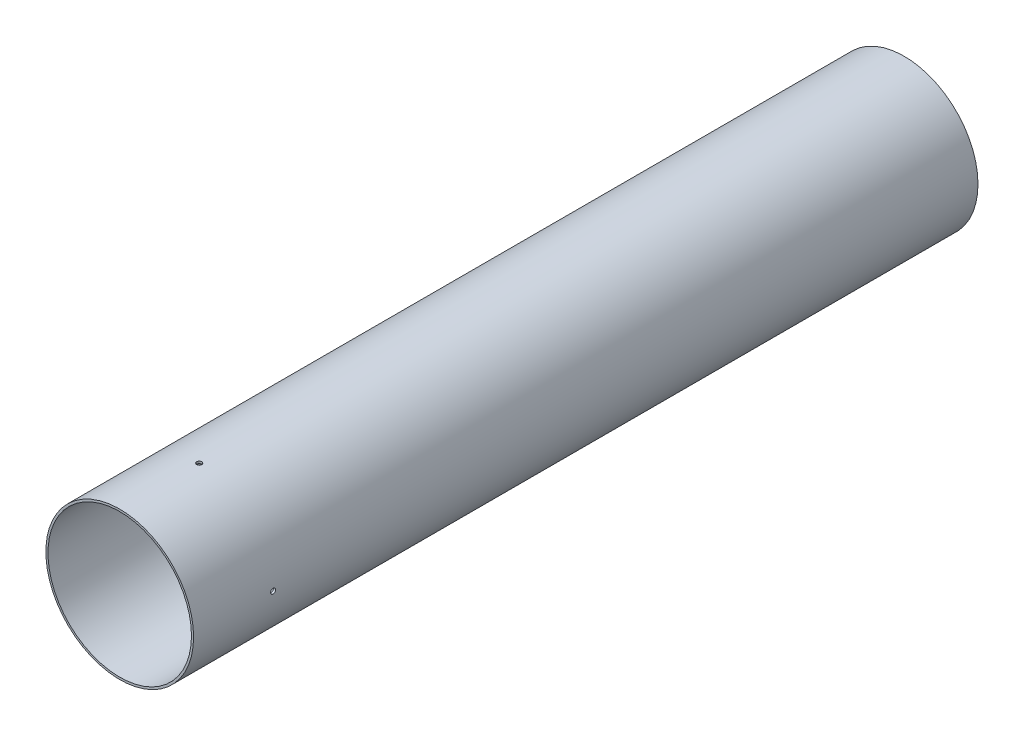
ISO-10303-21;
HEADER;
FILE_DESCRIPTION(('STEP AP214'),'2;1');
FILE_NAME('part.step','',(''),(''),'','','');
FILE_SCHEMA(('AUTOMOTIVE_DESIGN { 1 0 10303 214 1 1 1 1 }'));
ENDSEC;
DATA;
#1=APPLICATION_CONTEXT('core data for automotive mechanical design processes');
#2=APPLICATION_PROTOCOL_DEFINITION('international standard','automotive_design',2000,#1);
#3=PRODUCT_CONTEXT('',#1,'mechanical');
#4=PRODUCT('Part','Part','',(#3));
#5=PRODUCT_RELATED_PRODUCT_CATEGORY('part','',(#4));
#6=PRODUCT_DEFINITION_FORMATION('','',#4);
#7=PRODUCT_DEFINITION_CONTEXT('part definition',#1,'design');
#8=PRODUCT_DEFINITION('design','',#6,#7);
#9=PRODUCT_DEFINITION_SHAPE('','',#8);
#10=(LENGTH_UNIT() NAMED_UNIT(*) SI_UNIT(.MILLI.,.METRE.));
#11=(NAMED_UNIT(*) PLANE_ANGLE_UNIT() SI_UNIT($,.RADIAN.));
#12=(NAMED_UNIT(*) SI_UNIT($,.STERADIAN.) SOLID_ANGLE_UNIT());
#13=UNCERTAINTY_MEASURE_WITH_UNIT(LENGTH_MEASURE(1.E-05),#10,'distance_accuracy_value','');
#14=(GEOMETRIC_REPRESENTATION_CONTEXT(3) GLOBAL_UNCERTAINTY_ASSIGNED_CONTEXT((#13)) GLOBAL_UNIT_ASSIGNED_CONTEXT((#10,
#11,#12)) REPRESENTATION_CONTEXT('',''));
#15=CARTESIAN_POINT('',(0.,0.,0.));
#16=DIRECTION('',(0.,0.,1.));
#17=DIRECTION('',(1.,0.,0.));
#18=AXIS2_PLACEMENT_3D('',#15,#16,#17);
#19=CARTESIAN_POINT('',(0.,0.,744.22));
#20=DIRECTION('',(0.,0.,1.));
#21=DIRECTION('',(1.,0.,0.));
#22=AXIS2_PLACEMENT_3D('',#19,#20,#21);
#23=PLANE('',#22);
#24=CARTESIAN_POINT('',(0.,0.,744.22));
#25=DIRECTION('',(0.,0.,1.));
#26=DIRECTION('',(1.,0.,0.));
#27=AXIS2_PLACEMENT_3D('',#24,#25,#26);
#28=CIRCLE('',#27,70.0786);
#29=CARTESIAN_POINT('',(70.0786,0.,744.22));
#30=VERTEX_POINT('',#29);
#31=EDGE_CURVE('E10',#30,#30,#28,.T.);
#32=ORIENTED_EDGE('',*,*,#31,.T.);
#33=EDGE_LOOP('',(#32));
#34=FACE_BOUND('',#33,.T.);
#35=CARTESIAN_POINT('',(0.,0.,744.22));
#36=DIRECTION('',(0.,0.,1.));
#37=DIRECTION('',(1.,0.,0.));
#38=AXIS2_PLACEMENT_3D('',#35,#36,#37);
#39=CIRCLE('',#38,68.072);
#40=CARTESIAN_POINT('',(68.072,0.,744.22));
#41=VERTEX_POINT('',#40);
#42=EDGE_CURVE('E62',#41,#41,#39,.T.);
#43=ORIENTED_EDGE('',*,*,#42,.F.);
#44=EDGE_LOOP('',(#43));
#45=FACE_BOUND('',#44,.T.);
#46=ADVANCED_FACE('F41',(#34,#45),#23,.T.);
#47=CARTESIAN_POINT('',(0.,0.,0.));
#48=DIRECTION('',(0.,0.,1.));
#49=DIRECTION('',(1.,0.,0.));
#50=AXIS2_PLACEMENT_3D('',#47,#48,#49);
#51=PLANE('',#50);
#52=CARTESIAN_POINT('',(0.,0.,0.));
#53=DIRECTION('',(0.,0.,1.));
#54=DIRECTION('',(1.,0.,0.));
#55=AXIS2_PLACEMENT_3D('',#52,#53,#54);
#56=CIRCLE('',#55,70.0786);
#57=CARTESIAN_POINT('',(70.0786,0.,0.));
#58=VERTEX_POINT('',#57);
#59=EDGE_CURVE('E56',#58,#58,#56,.T.);
#60=ORIENTED_EDGE('',*,*,#59,.F.);
#61=EDGE_LOOP('',(#60));
#62=FACE_BOUND('',#61,.T.);
#63=CARTESIAN_POINT('',(0.,0.,0.));
#64=DIRECTION('',(0.,0.,1.));
#65=DIRECTION('',(1.,0.,0.));
#66=AXIS2_PLACEMENT_3D('',#63,#64,#65);
#67=CIRCLE('',#66,68.072);
#68=CARTESIAN_POINT('',(68.072,0.,0.));
#69=VERTEX_POINT('',#68);
#70=EDGE_CURVE('E65',#69,#69,#67,.T.);
#71=ORIENTED_EDGE('',*,*,#70,.T.);
#72=EDGE_LOOP('',(#71));
#73=FACE_BOUND('',#72,.T.);
#74=ADVANCED_FACE('F122',(#62,#73),#51,.F.);
#75=CARTESIAN_POINT('',(0.,0.,744.22));
#76=DIRECTION('',(0.,0.,-1.));
#77=DIRECTION('',(-1.,0.,0.));
#78=AXIS2_PLACEMENT_3D('',#75,#76,#77);
#79=CYLINDRICAL_SURFACE('',#78,70.0786);
#80=CARTESIAN_POINT('',(0.,-70.0786,671.21532));
#81=CARTESIAN_POINT('',(0.134783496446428,-70.0785994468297,671.215314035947));
#82=CARTESIAN_POINT('',(0.269663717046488,-70.078206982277,671.203929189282));
#83=CARTESIAN_POINT('',(0.53570657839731,-70.0766790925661,671.158672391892));
#84=CARTESIAN_POINT('',(0.666864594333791,-70.0755427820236,671.124773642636));
#85=CARTESIAN_POINT('',(0.921570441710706,-70.0726558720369,671.035457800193));
#86=CARTESIAN_POINT('',(1.04512198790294,-70.0709055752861,670.980051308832));
#87=CARTESIAN_POINT('',(1.2811360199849,-70.0669880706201,670.849308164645));
#88=CARTESIAN_POINT('',(1.39360118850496,-70.064820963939,670.773976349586));
#89=CARTESIAN_POINT('',(1.60434633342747,-70.0603124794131,670.605473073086));
#90=CARTESIAN_POINT('',(1.70261960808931,-70.0579710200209,670.512293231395));
#91=CARTESIAN_POINT('',(1.88213474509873,-70.0533784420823,670.310754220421));
#92=CARTESIAN_POINT('',(1.96337592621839,-70.0511273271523,670.202394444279));
#93=CARTESIAN_POINT('',(2.10653373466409,-70.0469688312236,669.973543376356));
#94=CARTESIAN_POINT('',(2.16844595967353,-70.0450615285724,669.853049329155));
#95=CARTESIAN_POINT('',(2.27115989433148,-70.0418065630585,669.60336966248));
#96=CARTESIAN_POINT('',(2.31196170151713,-70.04045889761,669.474184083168));
#97=CARTESIAN_POINT('',(2.37128114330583,-70.0384758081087,669.210842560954));
#98=CARTESIAN_POINT('',(2.38980758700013,-70.0378401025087,669.076688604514));
#99=CARTESIAN_POINT('',(2.40407755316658,-70.0373517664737,668.807173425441));
#100=CARTESIAN_POINT('',(2.39982118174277,-70.0374991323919,668.671812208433));
#101=CARTESIAN_POINT('',(2.36865375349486,-70.0385600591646,668.40378468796));
#102=CARTESIAN_POINT('',(2.34175221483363,-70.0394732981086,668.271117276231));
#103=CARTESIAN_POINT('',(2.26607281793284,-70.0419625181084,668.012182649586));
#104=CARTESIAN_POINT('',(2.21729490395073,-70.0435385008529,667.88591545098));
#105=CARTESIAN_POINT('',(2.09923646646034,-70.0471759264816,667.643334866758));
#106=CARTESIAN_POINT('',(2.02995158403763,-70.049237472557,667.527023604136));
#107=CARTESIAN_POINT('',(1.87284917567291,-70.0536135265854,667.307679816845));
#108=CARTESIAN_POINT('',(1.78503159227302,-70.0559280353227,667.204647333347));
#109=CARTESIAN_POINT('',(1.5933027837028,-70.0605505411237,667.014730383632));
#110=CARTESIAN_POINT('',(1.48938330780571,-70.062858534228,666.927854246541));
#111=CARTESIAN_POINT('',(1.26842969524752,-70.0672066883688,666.772780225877));
#112=CARTESIAN_POINT('',(1.15139555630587,-70.0692468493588,666.704582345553));
#113=CARTESIAN_POINT('',(0.907530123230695,-70.0728294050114,666.588801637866));
#114=CARTESIAN_POINT('',(0.780698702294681,-70.0743717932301,666.541219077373));
#115=CARTESIAN_POINT('',(0.5208410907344,-70.0767848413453,666.46802504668));
#116=CARTESIAN_POINT('',(0.387814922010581,-70.0776555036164,666.442413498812));
#117=CARTESIAN_POINT('',(0.119416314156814,-70.0786266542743,666.41389872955));
#118=CARTESIAN_POINT('',(-0.0159548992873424,-70.0787275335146,666.410983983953));
#119=CARTESIAN_POINT('',(-0.285264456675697,-70.078148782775,666.427915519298));
#120=CARTESIAN_POINT('',(-0.419202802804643,-70.0774691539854,666.44776176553));
#121=CARTESIAN_POINT('',(-0.681812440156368,-70.075406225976,666.509642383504));
#122=CARTESIAN_POINT('',(-0.810484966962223,-70.0740230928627,666.551671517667));
#123=CARTESIAN_POINT('',(-1.05894837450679,-70.0707089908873,666.656719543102));
#124=CARTESIAN_POINT('',(-1.17873923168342,-70.0687780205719,666.719738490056));
#125=CARTESIAN_POINT('',(-1.40609189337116,-70.0645847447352,666.865006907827));
#126=CARTESIAN_POINT('',(-1.5136487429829,-70.0623223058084,666.947264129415));
#127=CARTESIAN_POINT('',(-1.7134304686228,-70.0577214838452,667.128662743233));
#128=CARTESIAN_POINT('',(-1.8056552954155,-70.0553831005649,667.227804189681));
#129=CARTESIAN_POINT('',(-1.97219358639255,-70.0508928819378,667.44020640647));
#130=CARTESIAN_POINT('',(-2.0464996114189,-70.0487411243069,667.553473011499));
#131=CARTESIAN_POINT('',(-2.17504017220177,-70.0448679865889,667.790880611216));
#132=CARTESIAN_POINT('',(-2.2292747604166,-70.0431466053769,667.915021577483));
#133=CARTESIAN_POINT('',(-2.31611989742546,-70.0403288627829,668.170626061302));
#134=CARTESIAN_POINT('',(-2.34873524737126,-70.0392323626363,668.302087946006));
#135=CARTESIAN_POINT('',(-2.39143180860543,-70.0377876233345,668.568625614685));
#136=CARTESIAN_POINT('',(-2.40151305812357,-70.0374393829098,668.703701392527));
#137=CARTESIAN_POINT('',(-2.39885470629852,-70.0375304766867,668.973558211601));
#138=CARTESIAN_POINT('',(-2.38612682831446,-70.0379694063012,669.108339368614));
#139=CARTESIAN_POINT('',(-2.33823565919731,-70.0395845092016,669.373850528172));
#140=CARTESIAN_POINT('',(-2.30307232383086,-70.040760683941,669.50458052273));
#141=CARTESIAN_POINT('',(-2.2113102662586,-70.0437176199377,669.758282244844));
#142=CARTESIAN_POINT('',(-2.15471120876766,-70.0454983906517,669.881253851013));
#143=CARTESIAN_POINT('',(-2.02168766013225,-70.0494637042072,670.115947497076));
#144=CARTESIAN_POINT('',(-1.94526386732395,-70.0516482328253,670.227669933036));
#145=CARTESIAN_POINT('',(-1.77472300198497,-70.056175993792,670.43674941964));
#146=CARTESIAN_POINT('',(-1.6805987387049,-70.058519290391,670.534100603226));
#147=CARTESIAN_POINT('',(-1.47731517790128,-70.0631003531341,670.711646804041));
#148=CARTESIAN_POINT('',(-1.36815216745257,-70.0653380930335,670.791837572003));
#149=CARTESIAN_POINT('',(-1.13783987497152,-70.0694567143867,670.932804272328));
#150=CARTESIAN_POINT('',(-1.01668224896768,-70.0713373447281,670.993566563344));
#151=CARTESIAN_POINT('',(-0.765971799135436,-70.074525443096,671.093816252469));
#152=CARTESIAN_POINT('',(-0.636429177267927,-70.0758335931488,671.133328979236));
#153=CARTESIAN_POINT('',(-0.421725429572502,-70.0773803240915,671.179504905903));
#154=CARTESIAN_POINT('',(-0.337957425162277,-70.0778357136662,671.192918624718));
#155=CARTESIAN_POINT('',(-0.169472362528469,-70.0784457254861,671.210828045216));
#156=CARTESIAN_POINT('',(-0.0847553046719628,-70.0786003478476,671.215323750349));
#157=CARTESIAN_POINT('',(0.,-70.0786,671.21532));
#158=B_SPLINE_CURVE_WITH_KNOTS('',3,(#80,#81,#82,#83,#84,#85,#86,#87,#88,#89,#90,#91,#92,#93,
#94,#95,#96,#97,#98,#99,#100,#101,#102,#103,#104,#105,#106,#107,#108,#109,#110,#111,#112,#113,
#114,#115,#116,#117,#118,#119,#120,#121,#122,#123,#124,#125,#126,#127,#128,#129,#130,#131,#132,
#133,#134,#135,#136,#137,#138,#139,#140,#141,#142,#143,#144,#145,#146,#147,#148,#149,#150,#151,
#152,#153,#154,#155,#156,#157),.UNSPECIFIED.,.T.,.F.,(4,2,2,2,2,2,2,2,2,2,2,2,2,2,2,2,2,2,2,2,2,
2,2,2,2,2,2,2,2,2,2,2,2,2,2,2,2,2,4),(0.,0.40404111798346,0.808564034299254,1.21288780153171,
1.61711349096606,2.02152944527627,2.42596157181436,2.83048574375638,3.2350080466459,
3.6393703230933,4.04373071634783,4.44792123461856,4.85211278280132,5.25639030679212,
5.66066908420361,6.06515570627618,6.46964239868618,6.87413432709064,7.27862482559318,
7.68290993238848,8.08719442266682,8.49138350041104,8.89557365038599,9.29992692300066,
9.70428149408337,10.1088036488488,10.5133247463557,10.9177559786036,11.3221865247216,
11.7264092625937,12.130632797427,12.5348626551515,12.9390782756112,13.3434584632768,
13.7479386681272,14.152702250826,14.5569822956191,14.8110537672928,15.0651251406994),.UNSPECIFIED.);
#159=CARTESIAN_POINT('',(0.,-70.0786,671.21532));
#160=VERTEX_POINT('',#159);
#161=EDGE_CURVE('E77',#160,#160,#158,.T.);
#162=ORIENTED_EDGE('',*,*,#161,.T.);
#163=EDGE_LOOP('',(#162));
#164=FACE_BOUND('',#163,.T.);
#165=CARTESIAN_POINT('',(0.,70.0786,671.21532));
#166=CARTESIAN_POINT('',(-0.134783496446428,70.0785994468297,671.215314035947));
#167=CARTESIAN_POINT('',(-0.269663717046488,70.078206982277,671.203929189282));
#168=CARTESIAN_POINT('',(-0.53570657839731,70.0766790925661,671.158672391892));
#169=CARTESIAN_POINT('',(-0.666864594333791,70.0755427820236,671.124773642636));
#170=CARTESIAN_POINT('',(-0.921570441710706,70.0726558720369,671.035457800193));
#171=CARTESIAN_POINT('',(-1.04512198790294,70.0709055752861,670.980051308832));
#172=CARTESIAN_POINT('',(-1.2811360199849,70.0669880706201,670.849308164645));
#173=CARTESIAN_POINT('',(-1.39360118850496,70.064820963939,670.773976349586));
#174=CARTESIAN_POINT('',(-1.60434633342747,70.0603124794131,670.605473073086));
#175=CARTESIAN_POINT('',(-1.70261960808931,70.0579710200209,670.512293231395));
#176=CARTESIAN_POINT('',(-1.88213474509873,70.0533784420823,670.310754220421));
#177=CARTESIAN_POINT('',(-1.96337592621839,70.0511273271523,670.202394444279));
#178=CARTESIAN_POINT('',(-2.10653373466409,70.0469688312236,669.973543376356));
#179=CARTESIAN_POINT('',(-2.16844595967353,70.0450615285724,669.853049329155));
#180=CARTESIAN_POINT('',(-2.27115989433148,70.0418065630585,669.60336966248));
#181=CARTESIAN_POINT('',(-2.31196170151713,70.04045889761,669.474184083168));
#182=CARTESIAN_POINT('',(-2.37128114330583,70.0384758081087,669.210842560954));
#183=CARTESIAN_POINT('',(-2.38980758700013,70.0378401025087,669.076688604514));
#184=CARTESIAN_POINT('',(-2.40407755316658,70.0373517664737,668.807173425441));
#185=CARTESIAN_POINT('',(-2.39982118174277,70.0374991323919,668.671812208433));
#186=CARTESIAN_POINT('',(-2.36865375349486,70.0385600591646,668.40378468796));
#187=CARTESIAN_POINT('',(-2.34175221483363,70.0394732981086,668.271117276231));
#188=CARTESIAN_POINT('',(-2.26607281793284,70.0419625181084,668.012182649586));
#189=CARTESIAN_POINT('',(-2.21729490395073,70.0435385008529,667.88591545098));
#190=CARTESIAN_POINT('',(-2.09923646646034,70.0471759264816,667.643334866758));
#191=CARTESIAN_POINT('',(-2.02995158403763,70.049237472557,667.527023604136));
#192=CARTESIAN_POINT('',(-1.87284917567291,70.0536135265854,667.307679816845));
#193=CARTESIAN_POINT('',(-1.78503159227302,70.0559280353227,667.204647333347));
#194=CARTESIAN_POINT('',(-1.5933027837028,70.0605505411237,667.014730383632));
#195=CARTESIAN_POINT('',(-1.48938330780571,70.062858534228,666.927854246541));
#196=CARTESIAN_POINT('',(-1.26842969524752,70.0672066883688,666.772780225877));
#197=CARTESIAN_POINT('',(-1.15139555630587,70.0692468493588,666.704582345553));
#198=CARTESIAN_POINT('',(-0.907530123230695,70.0728294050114,666.588801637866));
#199=CARTESIAN_POINT('',(-0.780698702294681,70.0743717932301,666.541219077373));
#200=CARTESIAN_POINT('',(-0.5208410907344,70.0767848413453,666.46802504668));
#201=CARTESIAN_POINT('',(-0.387814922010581,70.0776555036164,666.442413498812));
#202=CARTESIAN_POINT('',(-0.119416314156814,70.0786266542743,666.41389872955));
#203=CARTESIAN_POINT('',(0.0159548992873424,70.0787275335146,666.410983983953));
#204=CARTESIAN_POINT('',(0.285264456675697,70.078148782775,666.427915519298));
#205=CARTESIAN_POINT('',(0.419202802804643,70.0774691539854,666.44776176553));
#206=CARTESIAN_POINT('',(0.681812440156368,70.075406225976,666.509642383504));
#207=CARTESIAN_POINT('',(0.810484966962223,70.0740230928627,666.551671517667));
#208=CARTESIAN_POINT('',(1.05894837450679,70.0707089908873,666.656719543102));
#209=CARTESIAN_POINT('',(1.17873923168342,70.0687780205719,666.719738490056));
#210=CARTESIAN_POINT('',(1.40609189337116,70.0645847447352,666.865006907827));
#211=CARTESIAN_POINT('',(1.5136487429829,70.0623223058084,666.947264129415));
#212=CARTESIAN_POINT('',(1.7134304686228,70.0577214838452,667.128662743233));
#213=CARTESIAN_POINT('',(1.8056552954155,70.0553831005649,667.227804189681));
#214=CARTESIAN_POINT('',(1.97219358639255,70.0508928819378,667.44020640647));
#215=CARTESIAN_POINT('',(2.0464996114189,70.0487411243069,667.553473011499));
#216=CARTESIAN_POINT('',(2.17504017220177,70.0448679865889,667.790880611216));
#217=CARTESIAN_POINT('',(2.2292747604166,70.0431466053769,667.915021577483));
#218=CARTESIAN_POINT('',(2.31611989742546,70.0403288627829,668.170626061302));
#219=CARTESIAN_POINT('',(2.34873524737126,70.0392323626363,668.302087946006));
#220=CARTESIAN_POINT('',(2.39143180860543,70.0377876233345,668.568625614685));
#221=CARTESIAN_POINT('',(2.40151305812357,70.0374393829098,668.703701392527));
#222=CARTESIAN_POINT('',(2.39885470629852,70.0375304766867,668.973558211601));
#223=CARTESIAN_POINT('',(2.38612682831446,70.0379694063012,669.108339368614));
#224=CARTESIAN_POINT('',(2.33823565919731,70.0395845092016,669.373850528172));
#225=CARTESIAN_POINT('',(2.30307232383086,70.040760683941,669.50458052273));
#226=CARTESIAN_POINT('',(2.2113102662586,70.0437176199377,669.758282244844));
#227=CARTESIAN_POINT('',(2.15471120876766,70.0454983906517,669.881253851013));
#228=CARTESIAN_POINT('',(2.02168766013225,70.0494637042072,670.115947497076));
#229=CARTESIAN_POINT('',(1.94526386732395,70.0516482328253,670.227669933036));
#230=CARTESIAN_POINT('',(1.77472300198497,70.056175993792,670.43674941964));
#231=CARTESIAN_POINT('',(1.6805987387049,70.058519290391,670.534100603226));
#232=CARTESIAN_POINT('',(1.47731517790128,70.0631003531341,670.711646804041));
#233=CARTESIAN_POINT('',(1.36815216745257,70.0653380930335,670.791837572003));
#234=CARTESIAN_POINT('',(1.13783987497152,70.0694567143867,670.932804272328));
#235=CARTESIAN_POINT('',(1.01668224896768,70.0713373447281,670.993566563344));
#236=CARTESIAN_POINT('',(0.765971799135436,70.074525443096,671.093816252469));
#237=CARTESIAN_POINT('',(0.636429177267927,70.0758335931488,671.133328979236));
#238=CARTESIAN_POINT('',(0.421725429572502,70.0773803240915,671.179504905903));
#239=CARTESIAN_POINT('',(0.337957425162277,70.0778357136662,671.192918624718));
#240=CARTESIAN_POINT('',(0.169472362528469,70.0784457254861,671.210828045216));
#241=CARTESIAN_POINT('',(0.0847553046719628,70.0786003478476,671.215323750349));
#242=CARTESIAN_POINT('',(0.,70.0786,671.21532));
#243=B_SPLINE_CURVE_WITH_KNOTS('',3,(#165,#166,#167,#168,#169,#170,#171,#172,#173,#174,#175,
#176,#177,#178,#179,#180,#181,#182,#183,#184,#185,#186,#187,#188,#189,#190,#191,#192,#193,#194,
#195,#196,#197,#198,#199,#200,#201,#202,#203,#204,#205,#206,#207,#208,#209,#210,#211,#212,#213,
#214,#215,#216,#217,#218,#219,#220,#221,#222,#223,#224,#225,#226,#227,#228,#229,#230,#231,#232,
#233,#234,#235,#236,#237,#238,#239,#240,#241,#242),.UNSPECIFIED.,.T.,.F.,(4,2,2,2,2,2,2,2,2,2,2,
2,2,2,2,2,2,2,2,2,2,2,2,2,2,2,2,2,2,2,2,2,2,2,2,2,2,2,4),(0.,0.40404111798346,0.808564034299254,
1.21288780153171,1.61711349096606,2.02152944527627,2.42596157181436,2.83048574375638,
3.2350080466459,3.6393703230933,4.04373071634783,4.44792123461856,4.85211278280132,
5.25639030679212,5.66066908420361,6.06515570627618,6.46964239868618,6.87413432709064,
7.27862482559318,7.68290993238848,8.08719442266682,8.49138350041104,8.89557365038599,
9.29992692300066,9.70428149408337,10.1088036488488,10.5133247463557,10.9177559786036,
11.3221865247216,11.7264092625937,12.130632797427,12.5348626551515,12.9390782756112,
13.3434584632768,13.7479386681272,14.152702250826,14.5569822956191,14.8110537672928,
15.0651251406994),.UNSPECIFIED.);
#244=CARTESIAN_POINT('',(0.,70.0786,671.21532));
#245=VERTEX_POINT('',#244);
#246=EDGE_CURVE('E211',#245,#245,#243,.T.);
#247=ORIENTED_EDGE('',*,*,#246,.T.);
#248=EDGE_LOOP('',(#247));
#249=FACE_BOUND('',#248,.T.);
#250=CARTESIAN_POINT('',(-70.0786,0.,666.41472));
#251=CARTESIAN_POINT('',(-70.0785994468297,0.134783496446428,666.414725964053));
#252=CARTESIAN_POINT('',(-70.078206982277,0.269663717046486,666.426110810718));
#253=CARTESIAN_POINT('',(-70.0766790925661,0.535706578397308,666.471367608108));
#254=CARTESIAN_POINT('',(-70.0755427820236,0.66686459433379,666.505266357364));
#255=CARTESIAN_POINT('',(-70.0726558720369,0.921570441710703,666.594582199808));
#256=CARTESIAN_POINT('',(-70.0709055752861,1.04512198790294,666.649988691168));
#257=CARTESIAN_POINT('',(-70.0669880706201,1.28113601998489,666.780731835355));
#258=CARTESIAN_POINT('',(-70.064820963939,1.39360118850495,666.856063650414));
#259=CARTESIAN_POINT('',(-70.0603124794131,1.60434633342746,667.024566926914));
#260=CARTESIAN_POINT('',(-70.0579710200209,1.7026196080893,667.117746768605));
#261=CARTESIAN_POINT('',(-70.0533784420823,1.88213474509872,667.319285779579));
#262=CARTESIAN_POINT('',(-70.0511273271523,1.96337592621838,667.427645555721));
#263=CARTESIAN_POINT('',(-70.0469688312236,2.10653373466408,667.656496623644));
#264=CARTESIAN_POINT('',(-70.0450615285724,2.16844595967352,667.776990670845));
#265=CARTESIAN_POINT('',(-70.0418065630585,2.27115989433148,668.02667033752));
#266=CARTESIAN_POINT('',(-70.04045889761,2.31196170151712,668.155855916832));
#267=CARTESIAN_POINT('',(-70.0384758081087,2.37128114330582,668.419197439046));
#268=CARTESIAN_POINT('',(-70.0378401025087,2.38980758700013,668.553351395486));
#269=CARTESIAN_POINT('',(-70.0373517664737,2.40407755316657,668.822866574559));
#270=CARTESIAN_POINT('',(-70.0374991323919,2.39982118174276,668.958227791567));
#271=CARTESIAN_POINT('',(-70.0385600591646,2.36865375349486,669.22625531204));
#272=CARTESIAN_POINT('',(-70.0394732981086,2.34175221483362,669.35892272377));
#273=CARTESIAN_POINT('',(-70.0419625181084,2.26607281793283,669.617857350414));
#274=CARTESIAN_POINT('',(-70.0435385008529,2.21729490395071,669.74412454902));
#275=CARTESIAN_POINT('',(-70.0471759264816,2.09923646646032,669.986705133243));
#276=CARTESIAN_POINT('',(-70.049237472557,2.0299515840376,670.103016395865));
#277=CARTESIAN_POINT('',(-70.0536135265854,1.87284917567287,670.322360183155));
#278=CARTESIAN_POINT('',(-70.0559280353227,1.78503159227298,670.425392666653));
#279=CARTESIAN_POINT('',(-70.0605505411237,1.59330278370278,670.615309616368));
#280=CARTESIAN_POINT('',(-70.062858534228,1.48938330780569,670.702185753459));
#281=CARTESIAN_POINT('',(-70.0672066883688,1.26842969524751,670.857259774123));
#282=CARTESIAN_POINT('',(-70.0692468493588,1.15139555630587,670.925457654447));
#283=CARTESIAN_POINT('',(-70.0728294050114,0.907530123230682,671.041238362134));
#284=CARTESIAN_POINT('',(-70.0743717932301,0.780698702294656,671.088820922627));
#285=CARTESIAN_POINT('',(-70.0767848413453,0.520841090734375,671.16201495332));
#286=CARTESIAN_POINT('',(-70.0776555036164,0.387814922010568,671.187626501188));
#287=CARTESIAN_POINT('',(-70.0786266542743,0.119416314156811,671.21614127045));
#288=CARTESIAN_POINT('',(-70.0787275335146,-0.0159548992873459,671.219056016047));
#289=CARTESIAN_POINT('',(-70.078148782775,-0.285264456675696,671.202124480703));
#290=CARTESIAN_POINT('',(-70.0774691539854,-0.419202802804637,671.18227823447));
#291=CARTESIAN_POINT('',(-70.075406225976,-0.681812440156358,671.120397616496));
#292=CARTESIAN_POINT('',(-70.0740230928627,-0.810484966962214,671.078368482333));
#293=CARTESIAN_POINT('',(-70.0707089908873,-1.05894837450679,670.973320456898));
#294=CARTESIAN_POINT('',(-70.0687780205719,-1.17873923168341,670.910301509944));
#295=CARTESIAN_POINT('',(-70.0645847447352,-1.40609189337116,670.765033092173));
#296=CARTESIAN_POINT('',(-70.0623223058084,-1.51364874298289,670.682775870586));
#297=CARTESIAN_POINT('',(-70.0577214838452,-1.71343046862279,670.501377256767));
#298=CARTESIAN_POINT('',(-70.0553831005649,-1.80565529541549,670.402235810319));
#299=CARTESIAN_POINT('',(-70.0508928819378,-1.97219358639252,670.18983359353));
#300=CARTESIAN_POINT('',(-70.0487411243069,-2.04649961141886,670.076566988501));
#301=CARTESIAN_POINT('',(-70.0448679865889,-2.17504017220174,669.839159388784));
#302=CARTESIAN_POINT('',(-70.0431466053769,-2.22927476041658,669.715018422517));
#303=CARTESIAN_POINT('',(-70.0403288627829,-2.31611989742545,669.459413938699));
#304=CARTESIAN_POINT('',(-70.0392323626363,-2.34873524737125,669.327952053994));
#305=CARTESIAN_POINT('',(-70.0377876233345,-2.39143180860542,669.061414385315));
#306=CARTESIAN_POINT('',(-70.0374393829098,-2.40151305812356,668.926338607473));
#307=CARTESIAN_POINT('',(-70.0375304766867,-2.39885470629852,668.656481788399));
#308=CARTESIAN_POINT('',(-70.0379694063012,-2.38612682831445,668.521700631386));
#309=CARTESIAN_POINT('',(-70.0395845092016,-2.3382356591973,668.256189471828));
#310=CARTESIAN_POINT('',(-70.040760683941,-2.30307232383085,668.12545947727));
#311=CARTESIAN_POINT('',(-70.0437176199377,-2.21131026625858,667.871757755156));
#312=CARTESIAN_POINT('',(-70.0454983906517,-2.15471120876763,667.748786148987));
#313=CARTESIAN_POINT('',(-70.0494637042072,-2.02168766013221,667.514092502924));
#314=CARTESIAN_POINT('',(-70.0516482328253,-1.94526386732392,667.402370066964));
#315=CARTESIAN_POINT('',(-70.056175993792,-1.77472300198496,667.19329058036));
#316=CARTESIAN_POINT('',(-70.058519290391,-1.68059873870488,667.095939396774));
#317=CARTESIAN_POINT('',(-70.0631003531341,-1.47731517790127,666.918393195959));
#318=CARTESIAN_POINT('',(-70.0653380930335,-1.36815216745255,666.838202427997));
#319=CARTESIAN_POINT('',(-70.0694567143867,-1.13783987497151,666.697235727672));
#320=CARTESIAN_POINT('',(-70.0713373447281,-1.01668224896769,666.636473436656));
#321=CARTESIAN_POINT('',(-70.074525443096,-0.765971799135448,666.536223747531));
#322=CARTESIAN_POINT('',(-70.0758335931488,-0.636429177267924,666.496711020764));
#323=CARTESIAN_POINT('',(-70.0773803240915,-0.421725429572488,666.450535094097));
#324=CARTESIAN_POINT('',(-70.0778357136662,-0.337957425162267,666.437121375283));
#325=CARTESIAN_POINT('',(-70.0784457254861,-0.169472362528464,666.419211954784));
#326=CARTESIAN_POINT('',(-70.0786003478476,-0.0847553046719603,666.414716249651));
#327=CARTESIAN_POINT('',(-70.0786,0.,666.41472));
#328=B_SPLINE_CURVE_WITH_KNOTS('',3,(#250,#251,#252,#253,#254,#255,#256,#257,#258,#259,#260,
#261,#262,#263,#264,#265,#266,#267,#268,#269,#270,#271,#272,#273,#274,#275,#276,#277,#278,#279,
#280,#281,#282,#283,#284,#285,#286,#287,#288,#289,#290,#291,#292,#293,#294,#295,#296,#297,#298,
#299,#300,#301,#302,#303,#304,#305,#306,#307,#308,#309,#310,#311,#312,#313,#314,#315,#316,#317,
#318,#319,#320,#321,#322,#323,#324,#325,#326,#327),.UNSPECIFIED.,.T.,.F.,(4,2,2,2,2,2,2,2,2,2,2,
2,2,2,2,2,2,2,2,2,2,2,2,2,2,2,2,2,2,2,2,2,2,2,2,2,2,2,4),(0.,0.404041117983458,
0.808564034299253,1.2128878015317,1.61711349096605,2.02152944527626,2.42596157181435,
2.83048574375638,3.23500804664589,3.6393703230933,4.04373071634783,4.44792123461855,
4.85211278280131,5.25639030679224,5.6606690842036,6.06515570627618,6.46964239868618,
6.8741343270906,7.27862482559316,7.68290993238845,8.08719442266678,8.49138350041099,
8.89557365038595,9.29992692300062,9.70428149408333,10.1088036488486,10.5133247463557,
10.9177559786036,11.3221865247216,11.7264092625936,12.1306327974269,12.5348626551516,
12.9390782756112,13.3434584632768,13.7479386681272,14.152702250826,14.556982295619,
14.8110537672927,15.0651251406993),.UNSPECIFIED.);
#329=CARTESIAN_POINT('',(-70.0786,0.,666.41472));
#330=VERTEX_POINT('',#329);
#331=EDGE_CURVE('E104',#330,#330,#328,.T.);
#332=ORIENTED_EDGE('',*,*,#331,.T.);
#333=EDGE_LOOP('',(#332));
#334=FACE_BOUND('',#333,.T.);
#335=CARTESIAN_POINT('',(70.0786,0.,666.41472));
#336=CARTESIAN_POINT('',(70.0785994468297,-0.134783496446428,666.414725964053));
#337=CARTESIAN_POINT('',(70.078206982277,-0.269663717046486,666.426110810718));
#338=CARTESIAN_POINT('',(70.0766790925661,-0.535706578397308,666.471367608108));
#339=CARTESIAN_POINT('',(70.0755427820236,-0.66686459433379,666.505266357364));
#340=CARTESIAN_POINT('',(70.0726558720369,-0.921570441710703,666.594582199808));
#341=CARTESIAN_POINT('',(70.0709055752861,-1.04512198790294,666.649988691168));
#342=CARTESIAN_POINT('',(70.0669880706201,-1.28113601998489,666.780731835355));
#343=CARTESIAN_POINT('',(70.064820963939,-1.39360118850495,666.856063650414));
#344=CARTESIAN_POINT('',(70.0603124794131,-1.60434633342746,667.024566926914));
#345=CARTESIAN_POINT('',(70.0579710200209,-1.7026196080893,667.117746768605));
#346=CARTESIAN_POINT('',(70.0533784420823,-1.88213474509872,667.319285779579));
#347=CARTESIAN_POINT('',(70.0511273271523,-1.96337592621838,667.427645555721));
#348=CARTESIAN_POINT('',(70.0469688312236,-2.10653373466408,667.656496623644));
#349=CARTESIAN_POINT('',(70.0450615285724,-2.16844595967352,667.776990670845));
#350=CARTESIAN_POINT('',(70.0418065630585,-2.27115989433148,668.02667033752));
#351=CARTESIAN_POINT('',(70.04045889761,-2.31196170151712,668.155855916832));
#352=CARTESIAN_POINT('',(70.0384758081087,-2.37128114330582,668.419197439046));
#353=CARTESIAN_POINT('',(70.0378401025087,-2.38980758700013,668.553351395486));
#354=CARTESIAN_POINT('',(70.0373517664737,-2.40407755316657,668.822866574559));
#355=CARTESIAN_POINT('',(70.0374991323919,-2.39982118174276,668.958227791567));
#356=CARTESIAN_POINT('',(70.0385600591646,-2.36865375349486,669.22625531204));
#357=CARTESIAN_POINT('',(70.0394732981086,-2.34175221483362,669.35892272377));
#358=CARTESIAN_POINT('',(70.0419625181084,-2.26607281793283,669.617857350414));
#359=CARTESIAN_POINT('',(70.0435385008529,-2.21729490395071,669.74412454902));
#360=CARTESIAN_POINT('',(70.0471759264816,-2.09923646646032,669.986705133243));
#361=CARTESIAN_POINT('',(70.049237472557,-2.0299515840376,670.103016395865));
#362=CARTESIAN_POINT('',(70.0536135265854,-1.87284917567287,670.322360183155));
#363=CARTESIAN_POINT('',(70.0559280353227,-1.78503159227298,670.425392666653));
#364=CARTESIAN_POINT('',(70.0605505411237,-1.59330278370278,670.615309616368));
#365=CARTESIAN_POINT('',(70.062858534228,-1.48938330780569,670.702185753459));
#366=CARTESIAN_POINT('',(70.0672066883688,-1.26842969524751,670.857259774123));
#367=CARTESIAN_POINT('',(70.0692468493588,-1.15139555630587,670.925457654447));
#368=CARTESIAN_POINT('',(70.0728294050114,-0.907530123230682,671.041238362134));
#369=CARTESIAN_POINT('',(70.0743717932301,-0.780698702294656,671.088820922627));
#370=CARTESIAN_POINT('',(70.0767848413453,-0.520841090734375,671.16201495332));
#371=CARTESIAN_POINT('',(70.0776555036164,-0.387814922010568,671.187626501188));
#372=CARTESIAN_POINT('',(70.0786266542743,-0.119416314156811,671.21614127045));
#373=CARTESIAN_POINT('',(70.0787275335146,0.0159548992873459,671.219056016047));
#374=CARTESIAN_POINT('',(70.078148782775,0.285264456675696,671.202124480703));
#375=CARTESIAN_POINT('',(70.0774691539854,0.419202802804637,671.18227823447));
#376=CARTESIAN_POINT('',(70.075406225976,0.681812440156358,671.120397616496));
#377=CARTESIAN_POINT('',(70.0740230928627,0.810484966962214,671.078368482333));
#378=CARTESIAN_POINT('',(70.0707089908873,1.05894837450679,670.973320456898));
#379=CARTESIAN_POINT('',(70.0687780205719,1.17873923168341,670.910301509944));
#380=CARTESIAN_POINT('',(70.0645847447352,1.40609189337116,670.765033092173));
#381=CARTESIAN_POINT('',(70.0623223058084,1.51364874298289,670.682775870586));
#382=CARTESIAN_POINT('',(70.0577214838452,1.71343046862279,670.501377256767));
#383=CARTESIAN_POINT('',(70.0553831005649,1.80565529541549,670.402235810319));
#384=CARTESIAN_POINT('',(70.0508928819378,1.97219358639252,670.18983359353));
#385=CARTESIAN_POINT('',(70.0487411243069,2.04649961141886,670.076566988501));
#386=CARTESIAN_POINT('',(70.0448679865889,2.17504017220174,669.839159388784));
#387=CARTESIAN_POINT('',(70.0431466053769,2.22927476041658,669.715018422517));
#388=CARTESIAN_POINT('',(70.0403288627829,2.31611989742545,669.459413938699));
#389=CARTESIAN_POINT('',(70.0392323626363,2.34873524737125,669.327952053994));
#390=CARTESIAN_POINT('',(70.0377876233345,2.39143180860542,669.061414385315));
#391=CARTESIAN_POINT('',(70.0374393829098,2.40151305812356,668.926338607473));
#392=CARTESIAN_POINT('',(70.0375304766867,2.39885470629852,668.656481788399));
#393=CARTESIAN_POINT('',(70.0379694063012,2.38612682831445,668.521700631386));
#394=CARTESIAN_POINT('',(70.0395845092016,2.3382356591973,668.256189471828));
#395=CARTESIAN_POINT('',(70.040760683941,2.30307232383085,668.12545947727));
#396=CARTESIAN_POINT('',(70.0437176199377,2.21131026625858,667.871757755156));
#397=CARTESIAN_POINT('',(70.0454983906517,2.15471120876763,667.748786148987));
#398=CARTESIAN_POINT('',(70.0494637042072,2.02168766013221,667.514092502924));
#399=CARTESIAN_POINT('',(70.0516482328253,1.94526386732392,667.402370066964));
#400=CARTESIAN_POINT('',(70.056175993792,1.77472300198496,667.19329058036));
#401=CARTESIAN_POINT('',(70.058519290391,1.68059873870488,667.095939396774));
#402=CARTESIAN_POINT('',(70.0631003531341,1.47731517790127,666.918393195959));
#403=CARTESIAN_POINT('',(70.0653380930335,1.36815216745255,666.838202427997));
#404=CARTESIAN_POINT('',(70.0694567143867,1.13783987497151,666.697235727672));
#405=CARTESIAN_POINT('',(70.0713373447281,1.01668224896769,666.636473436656));
#406=CARTESIAN_POINT('',(70.074525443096,0.765971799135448,666.536223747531));
#407=CARTESIAN_POINT('',(70.0758335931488,0.636429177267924,666.496711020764));
#408=CARTESIAN_POINT('',(70.0773803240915,0.421725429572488,666.450535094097));
#409=CARTESIAN_POINT('',(70.0778357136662,0.337957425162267,666.437121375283));
#410=CARTESIAN_POINT('',(70.0784457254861,0.169472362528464,666.419211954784));
#411=CARTESIAN_POINT('',(70.0786003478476,0.0847553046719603,666.414716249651));
#412=CARTESIAN_POINT('',(70.0786,0.,666.41472));
#413=B_SPLINE_CURVE_WITH_KNOTS('',3,(#335,#336,#337,#338,#339,#340,#341,#342,#343,#344,#345,
#346,#347,#348,#349,#350,#351,#352,#353,#354,#355,#356,#357,#358,#359,#360,#361,#362,#363,#364,
#365,#366,#367,#368,#369,#370,#371,#372,#373,#374,#375,#376,#377,#378,#379,#380,#381,#382,#383,
#384,#385,#386,#387,#388,#389,#390,#391,#392,#393,#394,#395,#396,#397,#398,#399,#400,#401,#402,
#403,#404,#405,#406,#407,#408,#409,#410,#411,#412),.UNSPECIFIED.,.T.,.F.,(4,2,2,2,2,2,2,2,2,2,2,
2,2,2,2,2,2,2,2,2,2,2,2,2,2,2,2,2,2,2,2,2,2,2,2,2,2,2,4),(0.,0.404041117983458,
0.808564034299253,1.2128878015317,1.61711349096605,2.02152944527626,2.42596157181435,
2.83048574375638,3.23500804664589,3.6393703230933,4.04373071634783,4.44792123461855,
4.85211278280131,5.25639030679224,5.6606690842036,6.06515570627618,6.46964239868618,
6.8741343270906,7.27862482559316,7.68290993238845,8.08719442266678,8.49138350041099,
8.89557365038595,9.29992692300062,9.70428149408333,10.1088036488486,10.5133247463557,
10.9177559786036,11.3221865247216,11.7264092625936,12.1306327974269,12.5348626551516,
12.9390782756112,13.3434584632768,13.7479386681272,14.152702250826,14.556982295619,
14.8110537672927,15.0651251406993),.UNSPECIFIED.);
#414=CARTESIAN_POINT('',(70.0786,0.,666.41472));
#415=VERTEX_POINT('',#414);
#416=EDGE_CURVE('E97',#415,#415,#413,.T.);
#417=ORIENTED_EDGE('',*,*,#416,.T.);
#418=EDGE_LOOP('',(#417));
#419=FACE_BOUND('',#418,.T.);
#420=ORIENTED_EDGE('',*,*,#31,.F.);
#421=EDGE_LOOP('',(#420));
#422=FACE_BOUND('',#421,.T.);
#423=ORIENTED_EDGE('',*,*,#59,.T.);
#424=EDGE_LOOP('',(#423));
#425=FACE_BOUND('',#424,.T.);
#426=ADVANCED_FACE('F43',(#164,#249,#334,#419,#422,#425),#79,.T.);
#427=CARTESIAN_POINT('',(0.,0.,744.22));
#428=DIRECTION('',(0.,0.,-1.));
#429=DIRECTION('',(-1.,0.,0.));
#430=AXIS2_PLACEMENT_3D('',#427,#428,#429);
#431=CYLINDRICAL_SURFACE('',#430,68.072);
#432=CARTESIAN_POINT('',(0.,-68.072,671.21532));
#433=CARTESIAN_POINT('',(0.134780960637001,-68.0719994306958,671.215314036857));
#434=CARTESIAN_POINT('',(0.269658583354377,-68.0715954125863,671.203929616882));
#435=CARTESIAN_POINT('',(0.535696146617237,-68.0700225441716,671.158674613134));
#436=CARTESIAN_POINT('',(0.666851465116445,-68.0688527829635,671.124777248));
#437=CARTESIAN_POINT('',(0.921551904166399,-68.0658808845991,671.035465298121));
#438=CARTESIAN_POINT('',(1.04510074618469,-68.0640790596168,670.980061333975));
#439=CARTESIAN_POINT('',(1.28110990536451,-68.060046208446,670.849324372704));
#440=CARTESIAN_POINT('',(1.39357290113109,-68.0578152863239,670.773996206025));
#441=CARTESIAN_POINT('',(1.60431698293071,-68.0531739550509,670.605499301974));
#442=CARTESIAN_POINT('',(1.70259105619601,-68.0507634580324,670.512321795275));
#443=CARTESIAN_POINT('',(1.88210837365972,-68.0460354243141,670.310787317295));
#444=CARTESIAN_POINT('',(1.96335093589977,-68.0437178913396,670.202429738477));
#445=CARTESIAN_POINT('',(2.10651319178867,-68.0394366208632,669.973580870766));
#446=CARTESIAN_POINT('',(2.16842819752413,-68.0374729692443,669.853086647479));
#447=CARTESIAN_POINT('',(2.27114748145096,-68.0341218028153,669.603405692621));
#448=CARTESIAN_POINT('',(2.3119518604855,-68.032734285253,669.474219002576));
#449=CARTESIAN_POINT('',(2.3712752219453,-68.0306925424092,669.210877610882));
#450=CARTESIAN_POINT('',(2.38980354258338,-68.0300380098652,669.076725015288));
#451=CARTESIAN_POINT('',(2.4040776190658,-68.0295351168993,668.80721214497));
#452=CARTESIAN_POINT('',(2.3998234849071,-68.0296867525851,668.671851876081));
#453=CARTESIAN_POINT('',(2.36866126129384,-68.0307788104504,668.403829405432));
#454=CARTESIAN_POINT('',(2.34176326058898,-68.0317188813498,668.271166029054));
#455=CARTESIAN_POINT('',(2.26609245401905,-68.0342812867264,668.012238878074));
#456=CARTESIAN_POINT('',(2.21731959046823,-68.0359036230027,667.88597512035));
#457=CARTESIAN_POINT('',(2.09927197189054,-68.0396480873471,667.643398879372));
#458=CARTESIAN_POINT('',(2.02999259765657,-68.0417703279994,667.527088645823));
#459=CARTESIAN_POINT('',(1.87290195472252,-68.0462752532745,667.307745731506));
#460=CARTESIAN_POINT('',(1.78509062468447,-68.0486579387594,667.204713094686));
#461=CARTESIAN_POINT('',(1.59337167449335,-68.0534167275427,667.014791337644));
#462=CARTESIAN_POINT('',(1.48945530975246,-68.0557928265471,666.927911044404));
#463=CARTESIAN_POINT('',(1.26850691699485,-68.0602693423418,666.772828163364));
#464=CARTESIAN_POINT('',(1.1514748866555,-68.0623697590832,666.70462557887));
#465=CARTESIAN_POINT('',(0.907612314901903,-68.0660581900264,666.588835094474));
#466=CARTESIAN_POINT('',(0.780781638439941,-68.0676461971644,666.541247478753));
#467=CARTESIAN_POINT('',(0.52092426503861,-68.070130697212,666.468043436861));
#468=CARTESIAN_POINT('',(0.387897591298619,-68.0710271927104,666.442426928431));
#469=CARTESIAN_POINT('',(0.119501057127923,-68.0720272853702,666.413903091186));
#470=CARTESIAN_POINT('',(-0.0158675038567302,-68.0721313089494,666.410983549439));
#471=CARTESIAN_POINT('',(-0.285172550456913,-68.0715358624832,666.427904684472));
#472=CARTESIAN_POINT('',(-0.419109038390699,-68.0708363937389,666.447745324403));
#473=CARTESIAN_POINT('',(-0.681713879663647,-68.0687130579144,666.509613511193));
#474=CARTESIAN_POINT('',(-0.810383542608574,-68.0672893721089,666.55163550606));
#475=CARTESIAN_POINT('',(-1.05884250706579,-68.0638779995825,666.656667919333));
#476=CARTESIAN_POINT('',(-1.17863178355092,-68.0618903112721,666.719678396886));
#477=CARTESIAN_POINT('',(-1.40598577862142,-68.0575737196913,666.864930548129));
#478=CARTESIAN_POINT('',(-1.5135452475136,-68.0552446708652,666.947180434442));
#479=CARTESIAN_POINT('',(-1.71333366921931,-68.050508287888,667.128564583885));
#480=CARTESIAN_POINT('',(-1.80556257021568,-68.0481009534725,667.227698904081));
#481=CARTESIAN_POINT('',(-1.97211267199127,-68.0434781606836,667.440090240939));
#482=CARTESIAN_POINT('',(-2.0464259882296,-68.0412627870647,667.553353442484));
#483=CARTESIAN_POINT('',(-2.17498154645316,-68.0372750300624,667.790755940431));
#484=CARTESIAN_POINT('',(-2.22922384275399,-68.0355026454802,667.914895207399));
#485=CARTESIAN_POINT('',(-2.31608381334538,-68.0326013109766,668.170496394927));
#486=CARTESIAN_POINT('',(-2.34870657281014,-68.031472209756,668.301956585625));
#487=CARTESIAN_POINT('',(-2.39141808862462,-68.0299843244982,668.568492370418));
#488=CARTESIAN_POINT('',(-2.40150688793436,-68.0296255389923,668.703567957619));
#489=CARTESIAN_POINT('',(-2.39886352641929,-68.0297187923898,668.973421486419));
#490=CARTESIAN_POINT('',(-2.38614378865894,-68.0301703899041,669.108199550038));
#491=CARTESIAN_POINT('',(-2.33827000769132,-68.0318325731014,669.373705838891));
#492=CARTESIAN_POINT('',(-2.30311592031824,-68.0330431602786,669.504434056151));
#493=CARTESIAN_POINT('',(-2.21137336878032,-68.0360867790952,669.758133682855));
#494=CARTESIAN_POINT('',(-2.15478457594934,-68.0379198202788,669.881104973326));
#495=CARTESIAN_POINT('',(-2.02178232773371,-68.0420016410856,670.115799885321));
#496=CARTESIAN_POINT('',(-1.94536956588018,-68.0442504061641,670.227523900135));
#497=CARTESIAN_POINT('',(-1.77484845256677,-68.0489114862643,670.436612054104));
#498=CARTESIAN_POINT('',(-1.68073236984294,-68.051323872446,670.533969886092));
#499=CARTESIAN_POINT('',(-1.4774639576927,-68.0560401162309,670.711530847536));
#500=CARTESIAN_POINT('',(-1.3683079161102,-68.0583439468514,670.791729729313));
#501=CARTESIAN_POINT('',(-1.13800628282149,-68.0625843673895,670.93271493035));
#502=CARTESIAN_POINT('',(-1.01685218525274,-68.0645206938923,670.993487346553));
#503=CARTESIAN_POINT('',(-0.766146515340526,-68.0678033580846,671.09375761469));
#504=CARTESIAN_POINT('',(-0.636605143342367,-68.0691503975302,671.133280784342));
#505=CARTESIAN_POINT('',(-0.421873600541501,-68.0707434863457,671.179479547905));
#506=CARTESIAN_POINT('',(-0.33807660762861,-68.0712126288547,671.192902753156));
#507=CARTESIAN_POINT('',(-0.169532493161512,-68.0718410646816,671.210824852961));
#508=CARTESIAN_POINT('',(-0.0847853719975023,-68.0720003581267,671.215323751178));
#509=CARTESIAN_POINT('',(0.,-68.072,671.21532));
#510=B_SPLINE_CURVE_WITH_KNOTS('',3,(#432,#433,#434,#435,#436,#437,#438,#439,#440,#441,#442,
#443,#444,#445,#446,#447,#448,#449,#450,#451,#452,#453,#454,#455,#456,#457,#458,#459,#460,#461,
#462,#463,#464,#465,#466,#467,#468,#469,#470,#471,#472,#473,#474,#475,#476,#477,#478,#479,#480,
#481,#482,#483,#484,#485,#486,#487,#488,#489,#490,#491,#492,#493,#494,#495,#496,#497,#498,#499,
#500,#501,#502,#503,#504,#505,#506,#507,#508,#509),.UNSPECIFIED.,.T.,.F.,(4,2,2,2,2,2,2,2,2,2,2,
2,2,2,2,2,2,2,2,2,2,2,2,2,2,2,2,2,2,2,2,2,2,2,2,2,2,2,4),(0.,0.404033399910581,
0.808548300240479,1.21286369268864,1.61708115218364,2.02149771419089,2.42593046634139,
2.83046123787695,3.23499007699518,3.63934927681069,4.043706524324,4.44788370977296,
4.85206196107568,5.25633132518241,5.66060202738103,6.06509301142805,6.4695840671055,
6.87408069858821,7.27857581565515,7.68285326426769,8.08713005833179,8.49130570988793,
8.89548250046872,9.29983213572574,9.70418313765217,10.1087117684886,10.5132393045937,
10.917671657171,11.3221032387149,11.7263146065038,12.1305267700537,12.5347451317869,
12.9389493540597,13.343330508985,13.7478116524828,14.1525816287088,14.5568682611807,
14.811029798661,15.0651912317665),.UNSPECIFIED.);
#511=CARTESIAN_POINT('',(0.,-68.072,671.21532));
#512=VERTEX_POINT('',#511);
#513=EDGE_CURVE('E46',#512,#512,#510,.T.);
#514=ORIENTED_EDGE('',*,*,#513,.F.);
#515=EDGE_LOOP('',(#514));
#516=FACE_BOUND('',#515,.T.);
#517=CARTESIAN_POINT('',(0.,68.072,671.21532));
#518=CARTESIAN_POINT('',(-0.134780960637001,68.0719994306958,671.215314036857));
#519=CARTESIAN_POINT('',(-0.269658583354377,68.0715954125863,671.203929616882));
#520=CARTESIAN_POINT('',(-0.535696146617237,68.0700225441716,671.158674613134));
#521=CARTESIAN_POINT('',(-0.666851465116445,68.0688527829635,671.124777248));
#522=CARTESIAN_POINT('',(-0.921551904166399,68.0658808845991,671.035465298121));
#523=CARTESIAN_POINT('',(-1.04510074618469,68.0640790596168,670.980061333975));
#524=CARTESIAN_POINT('',(-1.28110990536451,68.060046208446,670.849324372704));
#525=CARTESIAN_POINT('',(-1.39357290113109,68.0578152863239,670.773996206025));
#526=CARTESIAN_POINT('',(-1.60431698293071,68.0531739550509,670.605499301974));
#527=CARTESIAN_POINT('',(-1.70259105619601,68.0507634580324,670.512321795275));
#528=CARTESIAN_POINT('',(-1.88210837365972,68.0460354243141,670.310787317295));
#529=CARTESIAN_POINT('',(-1.96335093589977,68.0437178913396,670.202429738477));
#530=CARTESIAN_POINT('',(-2.10651319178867,68.0394366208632,669.973580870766));
#531=CARTESIAN_POINT('',(-2.16842819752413,68.0374729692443,669.853086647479));
#532=CARTESIAN_POINT('',(-2.27114748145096,68.0341218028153,669.603405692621));
#533=CARTESIAN_POINT('',(-2.3119518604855,68.032734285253,669.474219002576));
#534=CARTESIAN_POINT('',(-2.3712752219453,68.0306925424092,669.210877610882));
#535=CARTESIAN_POINT('',(-2.38980354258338,68.0300380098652,669.076725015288));
#536=CARTESIAN_POINT('',(-2.4040776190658,68.0295351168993,668.80721214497));
#537=CARTESIAN_POINT('',(-2.3998234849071,68.0296867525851,668.671851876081));
#538=CARTESIAN_POINT('',(-2.36866126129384,68.0307788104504,668.403829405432));
#539=CARTESIAN_POINT('',(-2.34176326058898,68.0317188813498,668.271166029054));
#540=CARTESIAN_POINT('',(-2.26609245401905,68.0342812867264,668.012238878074));
#541=CARTESIAN_POINT('',(-2.21731959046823,68.0359036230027,667.88597512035));
#542=CARTESIAN_POINT('',(-2.09927197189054,68.0396480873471,667.643398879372));
#543=CARTESIAN_POINT('',(-2.02999259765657,68.0417703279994,667.527088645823));
#544=CARTESIAN_POINT('',(-1.87290195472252,68.0462752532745,667.307745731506));
#545=CARTESIAN_POINT('',(-1.78509062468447,68.0486579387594,667.204713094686));
#546=CARTESIAN_POINT('',(-1.59337167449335,68.0534167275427,667.014791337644));
#547=CARTESIAN_POINT('',(-1.48945530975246,68.0557928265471,666.927911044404));
#548=CARTESIAN_POINT('',(-1.26850691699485,68.0602693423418,666.772828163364));
#549=CARTESIAN_POINT('',(-1.1514748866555,68.0623697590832,666.70462557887));
#550=CARTESIAN_POINT('',(-0.907612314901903,68.0660581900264,666.588835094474));
#551=CARTESIAN_POINT('',(-0.780781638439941,68.0676461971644,666.541247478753));
#552=CARTESIAN_POINT('',(-0.52092426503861,68.070130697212,666.468043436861));
#553=CARTESIAN_POINT('',(-0.387897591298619,68.0710271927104,666.442426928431));
#554=CARTESIAN_POINT('',(-0.119501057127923,68.0720272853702,666.413903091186));
#555=CARTESIAN_POINT('',(0.0158675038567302,68.0721313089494,666.410983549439));
#556=CARTESIAN_POINT('',(0.285172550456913,68.0715358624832,666.427904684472));
#557=CARTESIAN_POINT('',(0.419109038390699,68.0708363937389,666.447745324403));
#558=CARTESIAN_POINT('',(0.681713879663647,68.0687130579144,666.509613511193));
#559=CARTESIAN_POINT('',(0.810383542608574,68.0672893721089,666.55163550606));
#560=CARTESIAN_POINT('',(1.05884250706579,68.0638779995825,666.656667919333));
#561=CARTESIAN_POINT('',(1.17863178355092,68.0618903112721,666.719678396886));
#562=CARTESIAN_POINT('',(1.40598577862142,68.0575737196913,666.864930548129));
#563=CARTESIAN_POINT('',(1.5135452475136,68.0552446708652,666.947180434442));
#564=CARTESIAN_POINT('',(1.71333366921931,68.050508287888,667.128564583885));
#565=CARTESIAN_POINT('',(1.80556257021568,68.0481009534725,667.227698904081));
#566=CARTESIAN_POINT('',(1.97211267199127,68.0434781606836,667.440090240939));
#567=CARTESIAN_POINT('',(2.0464259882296,68.0412627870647,667.553353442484));
#568=CARTESIAN_POINT('',(2.17498154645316,68.0372750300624,667.790755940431));
#569=CARTESIAN_POINT('',(2.22922384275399,68.0355026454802,667.914895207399));
#570=CARTESIAN_POINT('',(2.31608381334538,68.0326013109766,668.170496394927));
#571=CARTESIAN_POINT('',(2.34870657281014,68.031472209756,668.301956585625));
#572=CARTESIAN_POINT('',(2.39141808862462,68.0299843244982,668.568492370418));
#573=CARTESIAN_POINT('',(2.40150688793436,68.0296255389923,668.703567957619));
#574=CARTESIAN_POINT('',(2.39886352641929,68.0297187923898,668.973421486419));
#575=CARTESIAN_POINT('',(2.38614378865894,68.0301703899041,669.108199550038));
#576=CARTESIAN_POINT('',(2.33827000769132,68.0318325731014,669.373705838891));
#577=CARTESIAN_POINT('',(2.30311592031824,68.0330431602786,669.504434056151));
#578=CARTESIAN_POINT('',(2.21137336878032,68.0360867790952,669.758133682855));
#579=CARTESIAN_POINT('',(2.15478457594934,68.0379198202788,669.881104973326));
#580=CARTESIAN_POINT('',(2.02178232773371,68.0420016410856,670.115799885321));
#581=CARTESIAN_POINT('',(1.94536956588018,68.0442504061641,670.227523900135));
#582=CARTESIAN_POINT('',(1.77484845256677,68.0489114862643,670.436612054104));
#583=CARTESIAN_POINT('',(1.68073236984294,68.051323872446,670.533969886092));
#584=CARTESIAN_POINT('',(1.4774639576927,68.0560401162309,670.711530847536));
#585=CARTESIAN_POINT('',(1.3683079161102,68.0583439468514,670.791729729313));
#586=CARTESIAN_POINT('',(1.13800628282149,68.0625843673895,670.93271493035));
#587=CARTESIAN_POINT('',(1.01685218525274,68.0645206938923,670.993487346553));
#588=CARTESIAN_POINT('',(0.766146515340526,68.0678033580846,671.09375761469));
#589=CARTESIAN_POINT('',(0.636605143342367,68.0691503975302,671.133280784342));
#590=CARTESIAN_POINT('',(0.421873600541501,68.0707434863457,671.179479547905));
#591=CARTESIAN_POINT('',(0.33807660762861,68.0712126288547,671.192902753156));
#592=CARTESIAN_POINT('',(0.169532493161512,68.0718410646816,671.210824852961));
#593=CARTESIAN_POINT('',(0.0847853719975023,68.0720003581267,671.215323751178));
#594=CARTESIAN_POINT('',(0.,68.072,671.21532));
#595=B_SPLINE_CURVE_WITH_KNOTS('',3,(#517,#518,#519,#520,#521,#522,#523,#524,#525,#526,#527,
#528,#529,#530,#531,#532,#533,#534,#535,#536,#537,#538,#539,#540,#541,#542,#543,#544,#545,#546,
#547,#548,#549,#550,#551,#552,#553,#554,#555,#556,#557,#558,#559,#560,#561,#562,#563,#564,#565,
#566,#567,#568,#569,#570,#571,#572,#573,#574,#575,#576,#577,#578,#579,#580,#581,#582,#583,#584,
#585,#586,#587,#588,#589,#590,#591,#592,#593,#594),.UNSPECIFIED.,.T.,.F.,(4,2,2,2,2,2,2,2,2,2,2,
2,2,2,2,2,2,2,2,2,2,2,2,2,2,2,2,2,2,2,2,2,2,2,2,2,2,2,4),(0.,0.404033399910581,
0.808548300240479,1.21286369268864,1.61708115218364,2.02149771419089,2.42593046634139,
2.83046123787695,3.23499007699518,3.63934927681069,4.043706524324,4.44788370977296,
4.85206196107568,5.25633132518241,5.66060202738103,6.06509301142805,6.4695840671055,
6.87408069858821,7.27857581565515,7.68285326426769,8.08713005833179,8.49130570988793,
8.89548250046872,9.29983213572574,9.70418313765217,10.1087117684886,10.5132393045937,
10.917671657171,11.3221032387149,11.7263146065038,12.1305267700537,12.5347451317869,
12.9389493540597,13.343330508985,13.7478116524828,14.1525816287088,14.5568682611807,
14.811029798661,15.0651912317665),.UNSPECIFIED.);
#596=CARTESIAN_POINT('',(0.,68.072,671.21532));
#597=VERTEX_POINT('',#596);
#598=EDGE_CURVE('E217',#597,#597,#595,.T.);
#599=ORIENTED_EDGE('',*,*,#598,.F.);
#600=EDGE_LOOP('',(#599));
#601=FACE_BOUND('',#600,.T.);
#602=CARTESIAN_POINT('',(-68.072,0.,671.21532));
#603=CARTESIAN_POINT('',(-68.0719994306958,-0.134780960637,671.215314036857));
#604=CARTESIAN_POINT('',(-68.0715954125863,-0.269658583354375,671.203929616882));
#605=CARTESIAN_POINT('',(-68.0700225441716,-0.535696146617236,671.158674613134));
#606=CARTESIAN_POINT('',(-68.0688527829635,-0.666851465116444,671.124777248));
#607=CARTESIAN_POINT('',(-68.0658808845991,-0.921551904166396,671.035465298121));
#608=CARTESIAN_POINT('',(-68.0640790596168,-1.04510074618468,670.980061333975));
#609=CARTESIAN_POINT('',(-68.060046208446,-1.2811099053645,670.849324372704));
#610=CARTESIAN_POINT('',(-68.0578152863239,-1.39357290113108,670.773996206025));
#611=CARTESIAN_POINT('',(-68.0531739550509,-1.60431698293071,670.605499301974));
#612=CARTESIAN_POINT('',(-68.0507634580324,-1.702591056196,670.512321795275));
#613=CARTESIAN_POINT('',(-68.0460354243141,-1.88210837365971,670.310787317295));
#614=CARTESIAN_POINT('',(-68.0437178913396,-1.96335093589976,670.202429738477));
#615=CARTESIAN_POINT('',(-68.0394366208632,-2.10651319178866,669.973580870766));
#616=CARTESIAN_POINT('',(-68.0374729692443,-2.16842819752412,669.853086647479));
#617=CARTESIAN_POINT('',(-68.0341218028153,-2.27114748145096,669.603405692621));
#618=CARTESIAN_POINT('',(-68.032734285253,-2.31195186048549,669.474219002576));
#619=CARTESIAN_POINT('',(-68.0306925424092,-2.37127522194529,669.210877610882));
#620=CARTESIAN_POINT('',(-68.0300380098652,-2.38980354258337,669.076725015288));
#621=CARTESIAN_POINT('',(-68.0295351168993,-2.40407761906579,668.80721214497));
#622=CARTESIAN_POINT('',(-68.0296867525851,-2.39982348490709,668.671851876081));
#623=CARTESIAN_POINT('',(-68.0307788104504,-2.36866126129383,668.403829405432));
#624=CARTESIAN_POINT('',(-68.0317188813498,-2.34176326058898,668.271166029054));
#625=CARTESIAN_POINT('',(-68.0342812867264,-2.26609245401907,668.012238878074));
#626=CARTESIAN_POINT('',(-68.0359036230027,-2.21731959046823,667.88597512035));
#627=CARTESIAN_POINT('',(-68.0396480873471,-2.09927197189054,667.643398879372));
#628=CARTESIAN_POINT('',(-68.0417703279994,-2.02999259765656,667.527088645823));
#629=CARTESIAN_POINT('',(-68.0462752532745,-1.87290195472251,667.307745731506));
#630=CARTESIAN_POINT('',(-68.0486579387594,-1.78509062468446,667.204713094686));
#631=CARTESIAN_POINT('',(-68.0534167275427,-1.59337167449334,667.014791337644));
#632=CARTESIAN_POINT('',(-68.0557928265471,-1.48945530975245,666.927911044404));
#633=CARTESIAN_POINT('',(-68.0602693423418,-1.26850691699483,666.772828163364));
#634=CARTESIAN_POINT('',(-68.0623697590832,-1.15147488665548,666.70462557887));
#635=CARTESIAN_POINT('',(-68.0660581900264,-0.907612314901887,666.588835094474));
#636=CARTESIAN_POINT('',(-68.0676461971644,-0.780781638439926,666.541247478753));
#637=CARTESIAN_POINT('',(-68.070130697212,-0.520924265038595,666.468043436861));
#638=CARTESIAN_POINT('',(-68.0710271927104,-0.387897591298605,666.442426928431));
#639=CARTESIAN_POINT('',(-68.0720272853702,-0.119501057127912,666.413903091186));
#640=CARTESIAN_POINT('',(-68.0721313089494,0.0158675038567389,666.410983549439));
#641=CARTESIAN_POINT('',(-68.0715358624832,0.285172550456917,666.427904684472));
#642=CARTESIAN_POINT('',(-68.0708363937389,0.419109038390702,666.447745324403));
#643=CARTESIAN_POINT('',(-68.0687130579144,0.681713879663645,666.509613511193));
#644=CARTESIAN_POINT('',(-68.067289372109,0.81038354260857,666.55163550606));
#645=CARTESIAN_POINT('',(-68.0638779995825,1.05884250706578,666.656667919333));
#646=CARTESIAN_POINT('',(-68.0618903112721,1.17863178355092,666.719678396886));
#647=CARTESIAN_POINT('',(-68.0575737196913,1.40598577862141,666.864930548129));
#648=CARTESIAN_POINT('',(-68.0552446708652,1.51354524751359,666.947180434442));
#649=CARTESIAN_POINT('',(-68.050508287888,1.7133336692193,667.128564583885));
#650=CARTESIAN_POINT('',(-68.0481009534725,1.80556257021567,667.227698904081));
#651=CARTESIAN_POINT('',(-68.0434781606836,1.97211267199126,667.440090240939));
#652=CARTESIAN_POINT('',(-68.0412627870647,2.04642598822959,667.553353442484));
#653=CARTESIAN_POINT('',(-68.0372750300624,2.17498154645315,667.790755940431));
#654=CARTESIAN_POINT('',(-68.0355026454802,2.22922384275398,667.914895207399));
#655=CARTESIAN_POINT('',(-68.0326013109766,2.31608381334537,668.170496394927));
#656=CARTESIAN_POINT('',(-68.031472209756,2.34870657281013,668.301956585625));
#657=CARTESIAN_POINT('',(-68.0299843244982,2.39141808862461,668.568492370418));
#658=CARTESIAN_POINT('',(-68.0296255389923,2.40150688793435,668.703567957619));
#659=CARTESIAN_POINT('',(-68.0297187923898,2.39886352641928,668.973421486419));
#660=CARTESIAN_POINT('',(-68.0301703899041,2.38614378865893,669.108199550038));
#661=CARTESIAN_POINT('',(-68.0318325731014,2.33827000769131,669.373705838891));
#662=CARTESIAN_POINT('',(-68.0330431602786,2.30311592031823,669.504434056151));
#663=CARTESIAN_POINT('',(-68.0360867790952,2.21137336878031,669.758133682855));
#664=CARTESIAN_POINT('',(-68.0379198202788,2.15478457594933,669.881104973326));
#665=CARTESIAN_POINT('',(-68.0420016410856,2.02178232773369,670.115799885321));
#666=CARTESIAN_POINT('',(-68.0442504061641,1.94536956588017,670.227523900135));
#667=CARTESIAN_POINT('',(-68.0489114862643,1.77484845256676,670.436612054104));
#668=CARTESIAN_POINT('',(-68.051323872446,1.68073236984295,670.533969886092));
#669=CARTESIAN_POINT('',(-68.0560401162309,1.47746395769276,670.711530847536));
#670=CARTESIAN_POINT('',(-68.0583439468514,1.3683079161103,670.791729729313));
#671=CARTESIAN_POINT('',(-68.0625843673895,1.13800628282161,670.93271493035));
#672=CARTESIAN_POINT('',(-68.0645206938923,1.01685218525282,670.993487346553));
#673=CARTESIAN_POINT('',(-68.0678033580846,0.766146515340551,671.09375761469));
#674=CARTESIAN_POINT('',(-68.0691503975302,0.636605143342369,671.133280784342));
#675=CARTESIAN_POINT('',(-68.0707434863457,0.421873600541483,671.179479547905));
#676=CARTESIAN_POINT('',(-68.0712126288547,0.338076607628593,671.192902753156));
#677=CARTESIAN_POINT('',(-68.0718410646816,0.169532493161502,671.210824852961));
#678=CARTESIAN_POINT('',(-68.0720003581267,0.0847853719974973,671.215323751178));
#679=CARTESIAN_POINT('',(-68.072,0.,671.21532));
#680=B_SPLINE_CURVE_WITH_KNOTS('',3,(#602,#603,#604,#605,#606,#607,#608,#609,#610,#611,#612,
#613,#614,#615,#616,#617,#618,#619,#620,#621,#622,#623,#624,#625,#626,#627,#628,#629,#630,#631,
#632,#633,#634,#635,#636,#637,#638,#639,#640,#641,#642,#643,#644,#645,#646,#647,#648,#649,#650,
#651,#652,#653,#654,#655,#656,#657,#658,#659,#660,#661,#662,#663,#664,#665,#666,#667,#668,#669,
#670,#671,#672,#673,#674,#675,#676,#677,#678,#679),.UNSPECIFIED.,.T.,.F.,(4,2,2,2,2,2,2,2,2,2,2,
2,2,2,2,2,2,2,2,2,2,2,2,2,2,2,2,2,2,2,2,2,2,2,2,2,2,2,4),(0.,0.404033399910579,
0.808548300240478,1.21286369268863,1.61708115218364,2.02149771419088,2.42593046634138,
2.83046123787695,3.23499007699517,3.63934927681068,4.04370652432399,4.44788370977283,
4.85206196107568,5.2563313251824,5.66060202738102,6.06509301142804,6.4695840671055,
6.87408069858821,7.27857581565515,7.68285326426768,8.08713005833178,8.49130570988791,
8.8954825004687,9.29983213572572,9.70418313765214,10.1087117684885,10.5132393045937,
10.917671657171,11.3221032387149,11.7263146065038,12.1305267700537,12.5347451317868,
12.9389493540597,13.343330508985,13.7478116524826,14.1525816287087,14.5568682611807,
14.811029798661,15.0651912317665),.UNSPECIFIED.);
#681=CARTESIAN_POINT('',(-68.072,0.,671.21532));
#682=VERTEX_POINT('',#681);
#683=EDGE_CURVE('E76',#682,#682,#680,.T.);
#684=ORIENTED_EDGE('',*,*,#683,.F.);
#685=EDGE_LOOP('',(#684));
#686=FACE_BOUND('',#685,.T.);
#687=CARTESIAN_POINT('',(68.072,0.,666.41472));
#688=CARTESIAN_POINT('',(68.0719994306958,-0.134780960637,666.414725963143));
#689=CARTESIAN_POINT('',(68.0715954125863,-0.269658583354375,666.426110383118));
#690=CARTESIAN_POINT('',(68.0700225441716,-0.535696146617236,666.471365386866));
#691=CARTESIAN_POINT('',(68.0688527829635,-0.666851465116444,666.505262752));
#692=CARTESIAN_POINT('',(68.0658808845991,-0.921551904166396,666.594574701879));
#693=CARTESIAN_POINT('',(68.0640790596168,-1.04510074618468,666.649978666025));
#694=CARTESIAN_POINT('',(68.060046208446,-1.2811099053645,666.780715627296));
#695=CARTESIAN_POINT('',(68.0578152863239,-1.39357290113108,666.856043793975));
#696=CARTESIAN_POINT('',(68.0531739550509,-1.60431698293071,667.024540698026));
#697=CARTESIAN_POINT('',(68.0507634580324,-1.702591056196,667.117718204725));
#698=CARTESIAN_POINT('',(68.0460354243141,-1.88210837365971,667.319252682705));
#699=CARTESIAN_POINT('',(68.0437178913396,-1.96335093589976,667.427610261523));
#700=CARTESIAN_POINT('',(68.0394366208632,-2.10651319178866,667.656459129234));
#701=CARTESIAN_POINT('',(68.0374729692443,-2.16842819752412,667.776953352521));
#702=CARTESIAN_POINT('',(68.0341218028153,-2.27114748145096,668.026634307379));
#703=CARTESIAN_POINT('',(68.032734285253,-2.31195186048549,668.155820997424));
#704=CARTESIAN_POINT('',(68.0306925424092,-2.37127522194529,668.419162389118));
#705=CARTESIAN_POINT('',(68.0300380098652,-2.38980354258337,668.553314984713));
#706=CARTESIAN_POINT('',(68.0295351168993,-2.40407761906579,668.82282785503));
#707=CARTESIAN_POINT('',(68.0296867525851,-2.39982348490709,668.95818812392));
#708=CARTESIAN_POINT('',(68.0307788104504,-2.36866126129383,669.226210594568));
#709=CARTESIAN_POINT('',(68.0317188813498,-2.34176326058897,669.358873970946));
#710=CARTESIAN_POINT('',(68.0342812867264,-2.26609245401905,669.617801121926));
#711=CARTESIAN_POINT('',(68.0359036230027,-2.21731959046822,669.74406487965));
#712=CARTESIAN_POINT('',(68.0396480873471,-2.09927197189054,669.986641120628));
#713=CARTESIAN_POINT('',(68.0417703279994,-2.02999259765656,670.102951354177));
#714=CARTESIAN_POINT('',(68.0462752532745,-1.87290195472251,670.322294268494));
#715=CARTESIAN_POINT('',(68.0486579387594,-1.78509062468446,670.425326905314));
#716=CARTESIAN_POINT('',(68.0534167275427,-1.59337167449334,670.615248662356));
#717=CARTESIAN_POINT('',(68.0557928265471,-1.48945530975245,670.702128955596));
#718=CARTESIAN_POINT('',(68.0602693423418,-1.26850691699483,670.857211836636));
#719=CARTESIAN_POINT('',(68.0623697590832,-1.15147488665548,670.92541442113));
#720=CARTESIAN_POINT('',(68.0660581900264,-0.907612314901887,671.041204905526));
#721=CARTESIAN_POINT('',(68.0676461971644,-0.780781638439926,671.088792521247));
#722=CARTESIAN_POINT('',(68.070130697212,-0.520924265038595,671.161996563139));
#723=CARTESIAN_POINT('',(68.0710271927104,-0.387897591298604,671.187613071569));
#724=CARTESIAN_POINT('',(68.0720272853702,-0.119501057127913,671.216136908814));
#725=CARTESIAN_POINT('',(68.0721313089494,0.0158675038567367,671.219056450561));
#726=CARTESIAN_POINT('',(68.0715358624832,0.28517255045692,671.202135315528));
#727=CARTESIAN_POINT('',(68.0708363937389,0.41910903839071,671.182294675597));
#728=CARTESIAN_POINT('',(68.0687130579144,0.681713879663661,671.120426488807));
#729=CARTESIAN_POINT('',(68.067289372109,0.810383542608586,671.07840449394));
#730=CARTESIAN_POINT('',(68.0638779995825,1.05884250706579,670.973372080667));
#731=CARTESIAN_POINT('',(68.0618903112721,1.17863178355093,670.910361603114));
#732=CARTESIAN_POINT('',(68.0575737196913,1.40598577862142,670.765109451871));
#733=CARTESIAN_POINT('',(68.0552446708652,1.5135452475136,670.682859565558));
#734=CARTESIAN_POINT('',(68.050508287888,1.71333366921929,670.501475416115));
#735=CARTESIAN_POINT('',(68.0481009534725,1.80556257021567,670.402341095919));
#736=CARTESIAN_POINT('',(68.0434781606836,1.97211267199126,670.189949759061));
#737=CARTESIAN_POINT('',(68.0412627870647,2.04642598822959,670.076686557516));
#738=CARTESIAN_POINT('',(68.0372750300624,2.17498154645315,669.839284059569));
#739=CARTESIAN_POINT('',(68.0355026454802,2.22922384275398,669.715144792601));
#740=CARTESIAN_POINT('',(68.0326013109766,2.31608381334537,669.459543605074));
#741=CARTESIAN_POINT('',(68.031472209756,2.34870657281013,669.328083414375));
#742=CARTESIAN_POINT('',(68.0299843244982,2.39141808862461,669.061547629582));
#743=CARTESIAN_POINT('',(68.0296255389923,2.40150688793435,668.926472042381));
#744=CARTESIAN_POINT('',(68.0297187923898,2.39886352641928,668.656618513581));
#745=CARTESIAN_POINT('',(68.0301703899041,2.38614378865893,668.521840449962));
#746=CARTESIAN_POINT('',(68.0318325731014,2.33827000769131,668.256334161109));
#747=CARTESIAN_POINT('',(68.0330431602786,2.30311592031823,668.125605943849));
#748=CARTESIAN_POINT('',(68.0360867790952,2.21137336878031,667.871906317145));
#749=CARTESIAN_POINT('',(68.0379198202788,2.15478457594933,667.748935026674));
#750=CARTESIAN_POINT('',(68.0420016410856,2.02178232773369,667.514240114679));
#751=CARTESIAN_POINT('',(68.0442504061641,1.94536956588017,667.402516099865));
#752=CARTESIAN_POINT('',(68.0489114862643,1.77484845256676,667.193427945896));
#753=CARTESIAN_POINT('',(68.051323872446,1.68073236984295,667.096070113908));
#754=CARTESIAN_POINT('',(68.0560401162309,1.47746395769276,666.918509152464));
#755=CARTESIAN_POINT('',(68.0583439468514,1.3683079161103,666.838310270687));
#756=CARTESIAN_POINT('',(68.0625843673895,1.13800628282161,666.69732506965));
#757=CARTESIAN_POINT('',(68.0645206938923,1.01685218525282,666.636552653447));
#758=CARTESIAN_POINT('',(68.0678033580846,0.766146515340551,666.53628238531));
#759=CARTESIAN_POINT('',(68.0691503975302,0.636605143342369,666.496759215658));
#760=CARTESIAN_POINT('',(68.0707434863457,0.421873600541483,666.450560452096));
#761=CARTESIAN_POINT('',(68.0712126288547,0.338076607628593,666.437137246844));
#762=CARTESIAN_POINT('',(68.0718410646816,0.169532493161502,666.419215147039));
#763=CARTESIAN_POINT('',(68.0720003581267,0.0847853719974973,666.414716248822));
#764=CARTESIAN_POINT('',(68.072,0.,666.41472));
#765=B_SPLINE_CURVE_WITH_KNOTS('',3,(#687,#688,#689,#690,#691,#692,#693,#694,#695,#696,#697,
#698,#699,#700,#701,#702,#703,#704,#705,#706,#707,#708,#709,#710,#711,#712,#713,#714,#715,#716,
#717,#718,#719,#720,#721,#722,#723,#724,#725,#726,#727,#728,#729,#730,#731,#732,#733,#734,#735,
#736,#737,#738,#739,#740,#741,#742,#743,#744,#745,#746,#747,#748,#749,#750,#751,#752,#753,#754,
#755,#756,#757,#758,#759,#760,#761,#762,#763,#764),.UNSPECIFIED.,.T.,.F.,(4,2,2,2,2,2,2,2,2,2,2,
2,2,2,2,2,2,2,2,2,2,2,2,2,2,2,2,2,2,2,2,2,2,2,2,2,2,2,4),(0.,0.404033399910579,
0.808548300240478,1.21286369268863,1.61708115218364,2.02149771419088,2.42593046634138,
2.83046123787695,3.23499007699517,3.63934927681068,4.04370652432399,4.44788370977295,
4.85206196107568,5.2563313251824,5.66060202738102,6.06509301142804,6.4695840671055,
6.87408069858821,7.27857581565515,7.68285326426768,8.08713005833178,8.49130570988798,
8.89548250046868,9.2998321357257,9.70418313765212,10.1087117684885,10.5132393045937,
10.917671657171,11.3221032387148,11.7263146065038,12.1305267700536,12.5347451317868,
12.9389493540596,13.343330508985,13.7478116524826,14.1525816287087,14.5568682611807,
14.811029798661,15.0651912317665),.UNSPECIFIED.);
#766=CARTESIAN_POINT('',(68.072,0.,666.41472));
#767=VERTEX_POINT('',#766);
#768=EDGE_CURVE('E68',#767,#767,#765,.T.);
#769=ORIENTED_EDGE('',*,*,#768,.F.);
#770=EDGE_LOOP('',(#769));
#771=FACE_BOUND('',#770,.T.);
#772=ORIENTED_EDGE('',*,*,#42,.T.);
#773=EDGE_LOOP('',(#772));
#774=FACE_BOUND('',#773,.T.);
#775=ORIENTED_EDGE('',*,*,#70,.F.);
#776=EDGE_LOOP('',(#775));
#777=FACE_BOUND('',#776,.T.);
#778=ADVANCED_FACE('F81',(#516,#601,#686,#771,#774,#777),#431,.F.);
#779=CARTESIAN_POINT('',(-70.0786,0.,668.81502));
#780=DIRECTION('',(1.,0.,0.));
#781=DIRECTION('',(0.,0.,-1.));
#782=AXIS2_PLACEMENT_3D('',#779,#780,#781);
#783=CYLINDRICAL_SURFACE('',#782,2.40030000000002);
#784=ORIENTED_EDGE('',*,*,#768,.T.);
#785=EDGE_LOOP('',(#784));
#786=FACE_BOUND('',#785,.T.);
#787=ORIENTED_EDGE('',*,*,#416,.F.);
#788=EDGE_LOOP('',(#787));
#789=FACE_BOUND('',#788,.T.);
#790=ADVANCED_FACE('F88',(#786,#789),#783,.F.);
#791=ORIENTED_EDGE('',*,*,#683,.T.);
#792=EDGE_LOOP('',(#791));
#793=FACE_BOUND('',#792,.T.);
#794=ORIENTED_EDGE('',*,*,#331,.F.);
#795=EDGE_LOOP('',(#794));
#796=FACE_BOUND('',#795,.T.);
#797=ADVANCED_FACE('F84',(#793,#796),#783,.F.);
#798=CARTESIAN_POINT('',(0.,-70.0786,668.81502));
#799=DIRECTION('',(0.,1.,0.));
#800=DIRECTION('',(0.,0.,1.));
#801=AXIS2_PLACEMENT_3D('',#798,#799,#800);
#802=CYLINDRICAL_SURFACE('',#801,2.40030000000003);
#803=ORIENTED_EDGE('',*,*,#598,.T.);
#804=EDGE_LOOP('',(#803));
#805=FACE_BOUND('',#804,.T.);
#806=ORIENTED_EDGE('',*,*,#246,.F.);
#807=EDGE_LOOP('',(#806));
#808=FACE_BOUND('',#807,.T.);
#809=ADVANCED_FACE('F87',(#805,#808),#802,.F.);
#810=ORIENTED_EDGE('',*,*,#513,.T.);
#811=EDGE_LOOP('',(#810));
#812=FACE_BOUND('',#811,.T.);
#813=ORIENTED_EDGE('',*,*,#161,.F.);
#814=EDGE_LOOP('',(#813));
#815=FACE_BOUND('',#814,.T.);
#816=ADVANCED_FACE('F90',(#812,#815),#802,.F.);
#817=CLOSED_SHELL('',(#46,#74,#426,#778,#790,#797,#809,#816));
#818=MANIFOLD_SOLID_BREP('B2',#817);
#819=ADVANCED_BREP_SHAPE_REPRESENTATION('',(#18,#818),#14);
#820=SHAPE_DEFINITION_REPRESENTATION(#9,#819);
ENDSEC;
END-ISO-10303-21;
